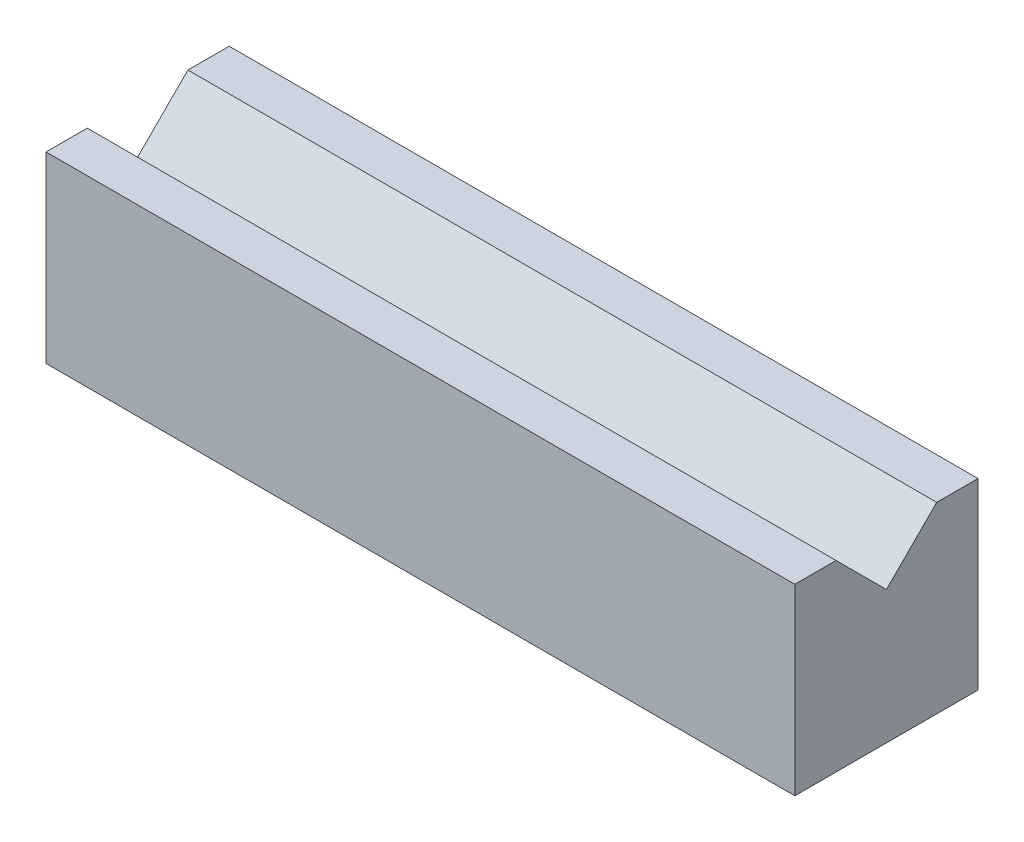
from build123d import *

# Parameters (mm, degrees)
EXTRUDE1_DEPTH          = 1.1557
EXTRUDE1_DEPTH_BACK     = 1.1557
SKETCH1_W               = 4.7244
SKETCH1_H               = 2.3114
CUT_EXTRUDE1_DEPTH      = 6.38499469
CUT_EXTRUDE1_DEPTH_BACK = 6.38499469


with BuildPart() as part:
    # Sketch1 → Extrude1 (new, two sides: drawn at the far end of the back side and taken through both)
    with BuildSketch(Plane.XY.offset(-EXTRUDE1_DEPTH_BACK)):
        with Locations((2.3622, 1.1557)):
            Rectangle(SKETCH1_W, SKETCH1_H)
    extrude(amount=EXTRUDE1_DEPTH + EXTRUDE1_DEPTH_BACK)

    # Mirror1: part across plane


with BuildPart() as part_1:
    add(part.part)
    add(part.part.mirror(Plane(origin=(0, 0, 0), x_dir=(0, 0, 1), z_dir=(1, 0, 0))))

    # Sketch2 → Cut-Extrude1 (cut, two sides: drawn at the far end of the back side and taken through both)
    with BuildSketch(Plane(origin=(0, 0, 0), x_dir=(0, 0, -1), z_dir=(1, 0, 0)).offset(-CUT_EXTRUDE1_DEPTH_BACK)):
        Polygon((-0.635, 2.3114), (0, 1.6764), (0.635, 2.3114), align=None)
    extrude(amount=CUT_EXTRUDE1_DEPTH + CUT_EXTRUDE1_DEPTH_BACK, mode=Mode.SUBTRACT)


solid = part_1.part
